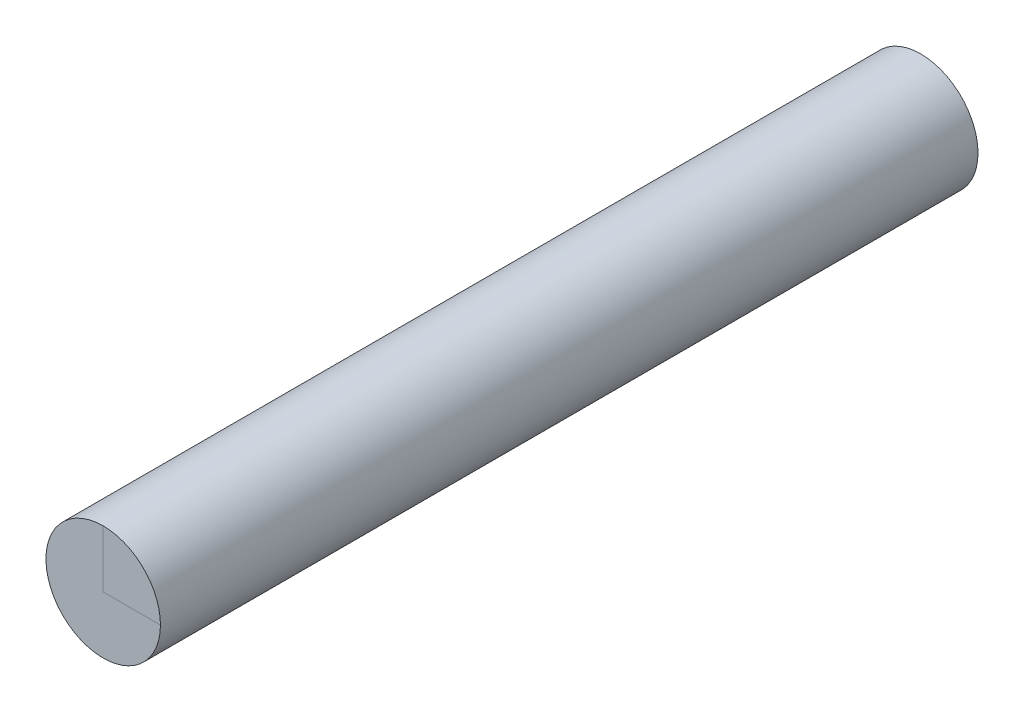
ISO-10303-21;
HEADER;
FILE_DESCRIPTION(('STEP AP214'),'2;1');
FILE_NAME('part.step','',(''),(''),'','','');
FILE_SCHEMA(('AUTOMOTIVE_DESIGN { 1 0 10303 214 1 1 1 1 }'));
ENDSEC;
DATA;
#1=APPLICATION_CONTEXT('core data for automotive mechanical design processes');
#2=APPLICATION_PROTOCOL_DEFINITION('international standard','automotive_design',2000,#1);
#3=PRODUCT_CONTEXT('',#1,'mechanical');
#4=PRODUCT('Part','Part','',(#3));
#5=PRODUCT_RELATED_PRODUCT_CATEGORY('part','',(#4));
#6=PRODUCT_DEFINITION_FORMATION('','',#4);
#7=PRODUCT_DEFINITION_CONTEXT('part definition',#1,'design');
#8=PRODUCT_DEFINITION('design','',#6,#7);
#9=PRODUCT_DEFINITION_SHAPE('','',#8);
#10=(LENGTH_UNIT() NAMED_UNIT(*) SI_UNIT(.MILLI.,.METRE.));
#11=(NAMED_UNIT(*) PLANE_ANGLE_UNIT() SI_UNIT($,.RADIAN.));
#12=(NAMED_UNIT(*) SI_UNIT($,.STERADIAN.) SOLID_ANGLE_UNIT());
#13=UNCERTAINTY_MEASURE_WITH_UNIT(LENGTH_MEASURE(1.E-05),#10,'distance_accuracy_value','');
#14=(GEOMETRIC_REPRESENTATION_CONTEXT(3) GLOBAL_UNCERTAINTY_ASSIGNED_CONTEXT((#13)) GLOBAL_UNIT_ASSIGNED_CONTEXT((#10,
#11,#12)) REPRESENTATION_CONTEXT('',''));
#15=CARTESIAN_POINT('',(0.,0.,0.));
#16=DIRECTION('',(0.,0.,1.));
#17=DIRECTION('',(1.,0.,0.));
#18=AXIS2_PLACEMENT_3D('',#15,#16,#17);
#19=CARTESIAN_POINT('',(14.986,0.,-214.0093455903));
#20=DIRECTION('',(0.,0.,-1.));
#21=DIRECTION('',(-1.,0.,0.));
#22=AXIS2_PLACEMENT_3D('',#19,#20,#21);
#23=PLANE('',#22);
#24=CARTESIAN_POINT('',(0.,0.,-214.0093455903));
#25=DIRECTION('',(0.,0.,1.));
#26=DIRECTION('',(1.,0.,0.));
#27=AXIS2_PLACEMENT_3D('',#24,#25,#26);
#28=CIRCLE('',#27,14.986);
#29=CARTESIAN_POINT('',(0.,14.986,-214.0093455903));
#30=VERTEX_POINT('',#29);
#31=CARTESIAN_POINT('',(14.986,0.,-214.0093455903));
#32=VERTEX_POINT('',#31);
#33=EDGE_CURVE('E83',#30,#32,#28,.T.);
#34=ORIENTED_EDGE('',*,*,#33,.F.);
#35=DIRECTION('',(0.,-1.,0.));
#36=VECTOR('',#35,1.);
#37=CARTESIAN_POINT('',(0.,0.,-214.0093455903));
#38=LINE('',#37,#36);
#39=CARTESIAN_POINT('',(0.,0.,-214.0093455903));
#40=VERTEX_POINT('',#39);
#41=EDGE_CURVE('E11',#30,#40,#38,.T.);
#42=ORIENTED_EDGE('',*,*,#41,.T.);
#43=DIRECTION('',(1.,0.,0.));
#44=VECTOR('',#43,1.);
#45=CARTESIAN_POINT('',(14.986,0.,-214.0093455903));
#46=LINE('',#45,#44);
#47=EDGE_CURVE('E46',#40,#32,#46,.T.);
#48=ORIENTED_EDGE('',*,*,#47,.T.);
#49=EDGE_LOOP('',(#34,#42,#48));
#50=FACE_BOUND('',#49,.T.);
#51=ADVANCED_FACE('F36',(#50),#23,.T.);
#52=CARTESIAN_POINT('',(0.,0.,0.));
#53=DIRECTION('',(0.,0.,1.));
#54=DIRECTION('',(1.,0.,0.));
#55=AXIS2_PLACEMENT_3D('',#52,#53,#54);
#56=PLANE('',#55);
#57=DIRECTION('',(-1.,0.,0.));
#58=VECTOR('',#57,1.);
#59=CARTESIAN_POINT('',(0.,0.,0.));
#60=LINE('',#59,#58);
#61=CARTESIAN_POINT('',(14.986,0.,0.));
#62=VERTEX_POINT('',#61);
#63=CARTESIAN_POINT('',(0.,0.,0.));
#64=VERTEX_POINT('',#63);
#65=EDGE_CURVE('E40',#62,#64,#60,.T.);
#66=ORIENTED_EDGE('',*,*,#65,.T.);
#67=DIRECTION('',(0.,1.,0.));
#68=VECTOR('',#67,1.);
#69=CARTESIAN_POINT('',(0.,0.,0.));
#70=LINE('',#69,#68);
#71=CARTESIAN_POINT('',(0.,14.9859999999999,0.));
#72=VERTEX_POINT('',#71);
#73=EDGE_CURVE('E74',#64,#72,#70,.T.);
#74=ORIENTED_EDGE('',*,*,#73,.T.);
#75=CARTESIAN_POINT('',(0.,0.,0.));
#76=DIRECTION('',(0.,0.,1.));
#77=DIRECTION('',(1.,0.,0.));
#78=AXIS2_PLACEMENT_3D('',#75,#76,#77);
#79=CIRCLE('',#78,14.986);
#80=EDGE_CURVE('E79',#72,#62,#79,.T.);
#81=ORIENTED_EDGE('',*,*,#80,.T.);
#82=EDGE_LOOP('',(#66,#74,#81));
#83=FACE_BOUND('',#82,.T.);
#84=ADVANCED_FACE('F80',(#83),#56,.T.);
#85=CARTESIAN_POINT('',(0.,0.,-135.040831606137));
#86=DIRECTION('',(0.,0.,1.));
#87=DIRECTION('',(1.,0.,0.));
#88=AXIS2_PLACEMENT_3D('',#85,#86,#87);
#89=CYLINDRICAL_SURFACE('',#88,14.986);
#90=EDGE_CURVE('E77',#32,#30,#28,.T.);
#91=ORIENTED_EDGE('',*,*,#90,.T.);
#92=ORIENTED_EDGE('',*,*,#33,.T.);
#93=EDGE_LOOP('',(#91,#92));
#94=FACE_BOUND('',#93,.T.);
#95=EDGE_CURVE('E73',#62,#72,#79,.T.);
#96=ORIENTED_EDGE('',*,*,#95,.F.);
#97=ORIENTED_EDGE('',*,*,#80,.F.);
#98=EDGE_LOOP('',(#96,#97));
#99=FACE_BOUND('',#98,.T.);
#100=ADVANCED_FACE('F38',(#94,#99),#89,.T.);
#101=ORIENTED_EDGE('',*,*,#41,.F.);
#102=ORIENTED_EDGE('',*,*,#90,.F.);
#103=ORIENTED_EDGE('',*,*,#47,.F.);
#104=EDGE_LOOP('',(#101,#102,#103));
#105=FACE_BOUND('',#104,.T.);
#106=ADVANCED_FACE('F93',(#105),#23,.T.);
#107=ORIENTED_EDGE('',*,*,#73,.F.);
#108=ORIENTED_EDGE('',*,*,#65,.F.);
#109=ORIENTED_EDGE('',*,*,#95,.T.);
#110=EDGE_LOOP('',(#107,#108,#109));
#111=FACE_BOUND('',#110,.T.);
#112=ADVANCED_FACE('F71',(#111),#56,.T.);
#113=CLOSED_SHELL('',(#51,#84,#100,#106,#112));
#114=MANIFOLD_SOLID_BREP('B2',#113);
#115=ADVANCED_BREP_SHAPE_REPRESENTATION('',(#18,#114),#14);
#116=SHAPE_DEFINITION_REPRESENTATION(#9,#115);
ENDSEC;
END-ISO-10303-21;
